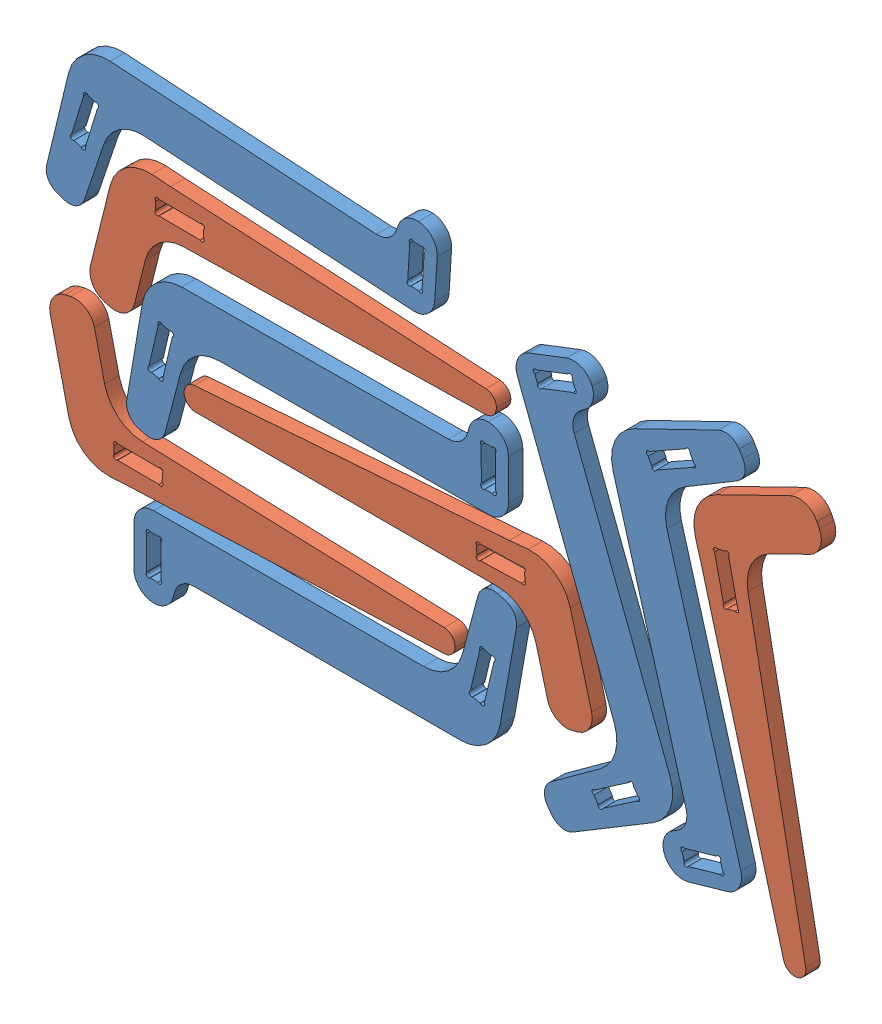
SolidWorks assembly Assemblage4.SLDASM, configuration Défaut (file format 10000). Lengths in mm.
Overall size (1158.26 614.52 18).
9 component instances, 2 part files, 8 mates.
Components (placement in the parent):
- Pièce1-1: Pièce1.SLDPRT [Défaut] at (-168.797 -165.6742 468.8632) size (477.86 225.67 18)
- Pièce6-1: Pièce6.SLDPRT [Défaut] at (472.4393 -593.1752 468.8632) x (-0.258819 0.965926 0) z (0 0 1) size (838.37 1121.22 18)
- Pièce6-2: Pièce6.SLDPRT [Défaut] at (-325.3008 567.7663 468.8632) x (0.226574 -0.973994 0) z (0 0 1) size (838.37 1121.22 18)
- Pièce1-2: Pièce1.SLDPRT [Défaut] at (298.8657 139.3248 468.8632) x (-0.99998 -0.006297 0) z (0 0 1) size (477.86 225.67 18)
- Pièce6-3: Pièce6.SLDPRT [Défaut] at (-282.7722 -425.3316 486.8632) x (0.240455 0.97066 0) z (0 0 -1) size (838.37 1121.22 18)
- Pièce1-3: Pièce1.SLDPRT [Défaut] at (208.3109 310.7542 468.8632) x (-0.998048 0.06245 0) z (0 0 1) size (477.86 225.67 18)
- Pièce1-4: Pièce1.SLDPRT [Défaut] at (347.7194 297.9506 486.8632) x (0.359032 -0.933325 0) z (0 0 -1) size (477.86 225.67 18)
- Pièce6-5: Pièce6.SLDPRT [Défaut] at (1160.6519 468.4365 468.8632) x (-0.898498 -0.438978 0) z (0 0 1) size (838.37 1121.22 18)
- Pièce1-6: Pièce1.SLDPRT [Défaut] at (547.7023 -176.4653 486.8632) x (-0.273961 0.961741 0) z (0 0 -1) size (477.86 225.67 18)
Mates (geometry in assembly coordinates):
- Coïncidente1: coincident aligned: plane of Pièce1-1 through (-143.897 -190.7742 486.8632) normal (0 0 1); plane of Pièce6-1 through (472.4393 -593.1752 486.8632) normal (0 0 1)
- Coïncidente5: coincident aligned: plane of Pièce1-1 through (-143.897 -190.7742 486.8632) normal (0 0 1); plane of Pièce6-2 through (-325.3008 567.7663 486.8632) normal (0 0 1)
- Coïncidente6: coincident aligned: plane of Pièce6-1 through (472.4393 -593.1752 486.8632) normal (0 0 1); plane of Pièce1-2 through (273.8082 164.2675 486.8632) normal (0 0 1)
- Coïncidente8: coincident aligned: plane of Pièce1-2 through (273.8082 164.2675 486.8632) normal (0 0 1); plane of Pièce6-3 through (-282.7722 -425.3316 486.8632) normal (0 0 1)
- Coïncidente10: coincident aligned: plane of Pièce6-3 through (-282.7722 -425.3316 486.8632) normal (0 0 1); plane of Pièce1-3 through (185.027 337.3602 486.8632) normal (0 0 1)
- Coïncidente12: coincident aligned: plane of Pièce1-3 through (185.027 337.3602 486.8632) normal (0 0 1); plane of Pièce1-4 through (380.0858 283.7225 486.8632) normal (0 0 1)
- Coïncidente15: coincident aligned: plane of Pièce1-4 through (380.0858 283.7225 486.8632) normal (0 0 1); plane of Pièce1-6 through (516.741 -159.3943 486.8632) normal (0 0 1)
- Coïncidente16: coincident aligned: plane of Pièce6-5 through (1160.6519 468.4365 486.8632) normal (0 0 1); plane of Pièce1-6 through (516.741 -159.3943 486.8632) normal (0 0 1)
